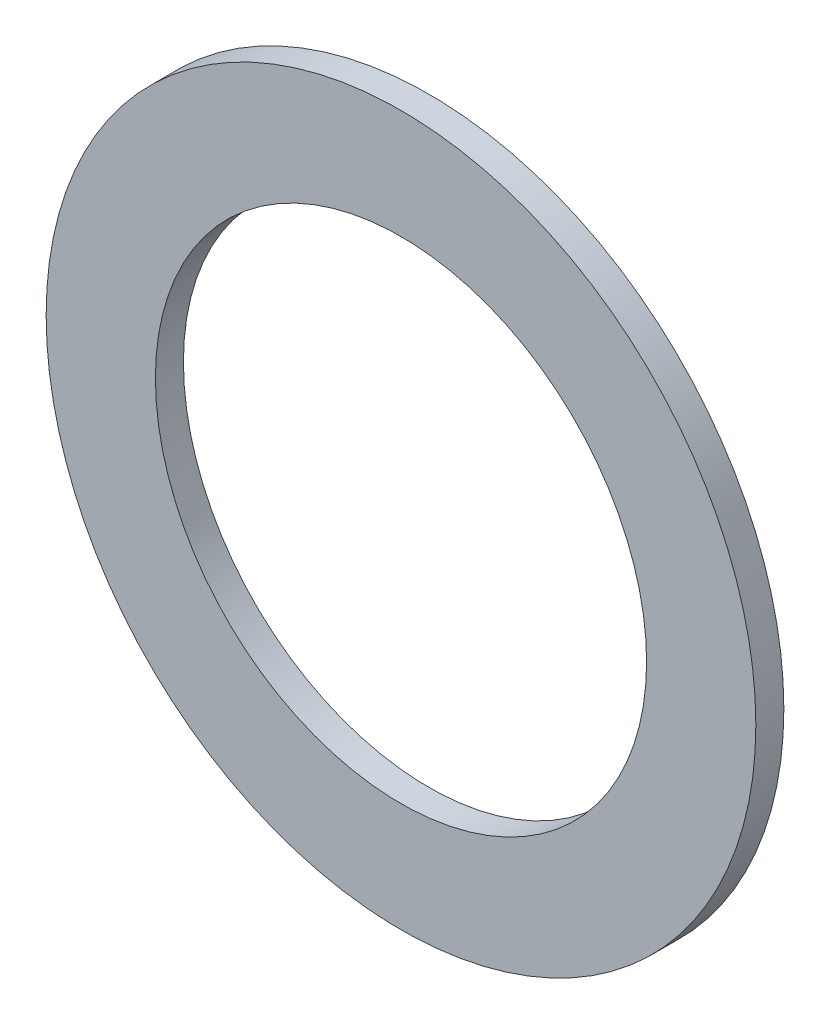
ISO-10303-21;
HEADER;
FILE_DESCRIPTION(('STEP AP214'),'2;1');
FILE_NAME('part.step','',(''),(''),'','','');
FILE_SCHEMA(('AUTOMOTIVE_DESIGN { 1 0 10303 214 1 1 1 1 }'));
ENDSEC;
DATA;
#1=APPLICATION_CONTEXT('core data for automotive mechanical design processes');
#2=APPLICATION_PROTOCOL_DEFINITION('international standard','automotive_design',2000,#1);
#3=PRODUCT_CONTEXT('',#1,'mechanical');
#4=PRODUCT('Part','Part','',(#3));
#5=PRODUCT_RELATED_PRODUCT_CATEGORY('part','',(#4));
#6=PRODUCT_DEFINITION_FORMATION('','',#4);
#7=PRODUCT_DEFINITION_CONTEXT('part definition',#1,'design');
#8=PRODUCT_DEFINITION('design','',#6,#7);
#9=PRODUCT_DEFINITION_SHAPE('','',#8);
#10=(LENGTH_UNIT() NAMED_UNIT(*) SI_UNIT(.MILLI.,.METRE.));
#11=(NAMED_UNIT(*) PLANE_ANGLE_UNIT() SI_UNIT($,.RADIAN.));
#12=(NAMED_UNIT(*) SI_UNIT($,.STERADIAN.) SOLID_ANGLE_UNIT());
#13=UNCERTAINTY_MEASURE_WITH_UNIT(LENGTH_MEASURE(1.E-05),#10,'distance_accuracy_value','');
#14=(GEOMETRIC_REPRESENTATION_CONTEXT(3) GLOBAL_UNCERTAINTY_ASSIGNED_CONTEXT((#13)) GLOBAL_UNIT_ASSIGNED_CONTEXT((#10,
#11,#12)) REPRESENTATION_CONTEXT('',''));
#15=CARTESIAN_POINT('',(0.,0.,0.));
#16=DIRECTION('',(0.,0.,1.));
#17=DIRECTION('',(1.,0.,0.));
#18=AXIS2_PLACEMENT_3D('',#15,#16,#17);
#19=CARTESIAN_POINT('',(0.,0.,1.5));
#20=DIRECTION('',(0.,0.,1.));
#21=DIRECTION('',(1.,0.,0.));
#22=AXIS2_PLACEMENT_3D('',#19,#20,#21);
#23=PLANE('',#22);
#24=CARTESIAN_POINT('',(0.,0.,1.5));
#25=DIRECTION('',(0.,0.,1.));
#26=DIRECTION('',(1.,0.,0.));
#27=AXIS2_PLACEMENT_3D('',#24,#25,#26);
#28=CIRCLE('',#27,19.);
#29=CARTESIAN_POINT('',(19.,0.,1.5));
#30=VERTEX_POINT('',#29);
#31=EDGE_CURVE('E10',#30,#30,#28,.T.);
#32=ORIENTED_EDGE('',*,*,#31,.T.);
#33=EDGE_LOOP('',(#32));
#34=FACE_BOUND('',#33,.T.);
#35=CARTESIAN_POINT('',(0.,0.,1.5));
#36=DIRECTION('',(0.,0.,1.));
#37=DIRECTION('',(1.,0.,0.));
#38=AXIS2_PLACEMENT_3D('',#35,#36,#37);
#39=CIRCLE('',#38,13.15);
#40=CARTESIAN_POINT('',(13.15,0.,1.5));
#41=VERTEX_POINT('',#40);
#42=EDGE_CURVE('E38',#41,#41,#39,.T.);
#43=ORIENTED_EDGE('',*,*,#42,.F.);
#44=EDGE_LOOP('',(#43));
#45=FACE_BOUND('',#44,.T.);
#46=ADVANCED_FACE('F27',(#34,#45),#23,.T.);
#47=CARTESIAN_POINT('',(0.,0.,0.));
#48=DIRECTION('',(0.,0.,1.));
#49=DIRECTION('',(1.,0.,0.));
#50=AXIS2_PLACEMENT_3D('',#47,#48,#49);
#51=PLANE('',#50);
#52=CARTESIAN_POINT('',(0.,0.,0.));
#53=DIRECTION('',(0.,0.,1.));
#54=DIRECTION('',(1.,0.,0.));
#55=AXIS2_PLACEMENT_3D('',#52,#53,#54);
#56=CIRCLE('',#55,19.);
#57=CARTESIAN_POINT('',(19.,0.,0.));
#58=VERTEX_POINT('',#57);
#59=EDGE_CURVE('E34',#58,#58,#56,.T.);
#60=ORIENTED_EDGE('',*,*,#59,.F.);
#61=EDGE_LOOP('',(#60));
#62=FACE_BOUND('',#61,.T.);
#63=CARTESIAN_POINT('',(0.,0.,0.));
#64=DIRECTION('',(0.,0.,1.));
#65=DIRECTION('',(1.,0.,0.));
#66=AXIS2_PLACEMENT_3D('',#63,#64,#65);
#67=CIRCLE('',#66,13.15);
#68=CARTESIAN_POINT('',(13.15,0.,0.));
#69=VERTEX_POINT('',#68);
#70=EDGE_CURVE('E42',#69,#69,#67,.T.);
#71=ORIENTED_EDGE('',*,*,#70,.T.);
#72=EDGE_LOOP('',(#71));
#73=FACE_BOUND('',#72,.T.);
#74=ADVANCED_FACE('F48',(#62,#73),#51,.F.);
#75=CARTESIAN_POINT('',(0.,0.,1.5));
#76=DIRECTION('',(0.,0.,-1.));
#77=DIRECTION('',(-1.,0.,0.));
#78=AXIS2_PLACEMENT_3D('',#75,#76,#77);
#79=CYLINDRICAL_SURFACE('',#78,19.);
#80=ORIENTED_EDGE('',*,*,#31,.F.);
#81=EDGE_LOOP('',(#80));
#82=FACE_BOUND('',#81,.T.);
#83=ORIENTED_EDGE('',*,*,#59,.T.);
#84=EDGE_LOOP('',(#83));
#85=FACE_BOUND('',#84,.T.);
#86=ADVANCED_FACE('F29',(#82,#85),#79,.T.);
#87=CARTESIAN_POINT('',(0.,0.,1.5));
#88=DIRECTION('',(0.,0.,-1.));
#89=DIRECTION('',(-1.,0.,0.));
#90=AXIS2_PLACEMENT_3D('',#87,#88,#89);
#91=CYLINDRICAL_SURFACE('',#90,13.15);
#92=ORIENTED_EDGE('',*,*,#42,.T.);
#93=EDGE_LOOP('',(#92));
#94=FACE_BOUND('',#93,.T.);
#95=ORIENTED_EDGE('',*,*,#70,.F.);
#96=EDGE_LOOP('',(#95));
#97=FACE_BOUND('',#96,.T.);
#98=ADVANCED_FACE('F50',(#94,#97),#91,.F.);
#99=CLOSED_SHELL('',(#46,#74,#86,#98));
#100=MANIFOLD_SOLID_BREP('B2',#99);
#101=ADVANCED_BREP_SHAPE_REPRESENTATION('',(#18,#100),#14);
#102=SHAPE_DEFINITION_REPRESENTATION(#9,#101);
ENDSEC;
END-ISO-10303-21;
